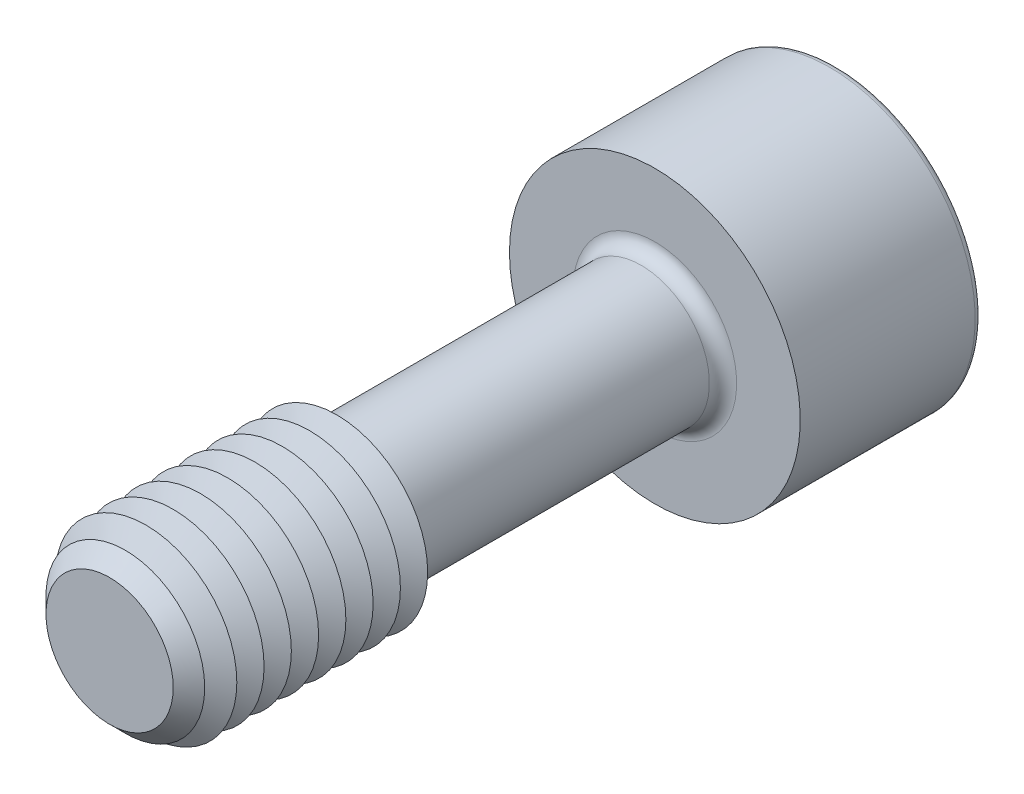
ISO-10303-21;
HEADER;
FILE_DESCRIPTION(('STEP AP214'),'2;1');
FILE_NAME('part.step','',(''),(''),'','','');
FILE_SCHEMA(('AUTOMOTIVE_DESIGN { 1 0 10303 214 1 1 1 1 }'));
ENDSEC;
DATA;
#1=APPLICATION_CONTEXT('core data for automotive mechanical design processes');
#2=APPLICATION_PROTOCOL_DEFINITION('international standard','automotive_design',2000,#1);
#3=PRODUCT_CONTEXT('',#1,'mechanical');
#4=PRODUCT('Part','Part','',(#3));
#5=PRODUCT_RELATED_PRODUCT_CATEGORY('part','',(#4));
#6=PRODUCT_DEFINITION_FORMATION('','',#4);
#7=PRODUCT_DEFINITION_CONTEXT('part definition',#1,'design');
#8=PRODUCT_DEFINITION('design','',#6,#7);
#9=PRODUCT_DEFINITION_SHAPE('','',#8);
#10=(LENGTH_UNIT() NAMED_UNIT(*) SI_UNIT(.MILLI.,.METRE.));
#11=(NAMED_UNIT(*) PLANE_ANGLE_UNIT() SI_UNIT($,.RADIAN.));
#12=(NAMED_UNIT(*) SI_UNIT($,.STERADIAN.) SOLID_ANGLE_UNIT());
#13=UNCERTAINTY_MEASURE_WITH_UNIT(LENGTH_MEASURE(1.E-05),#10,'distance_accuracy_value','');
#14=(GEOMETRIC_REPRESENTATION_CONTEXT(3) GLOBAL_UNCERTAINTY_ASSIGNED_CONTEXT((#13)) GLOBAL_UNIT_ASSIGNED_CONTEXT((#10,
#11,#12)) REPRESENTATION_CONTEXT('',''));
#15=CARTESIAN_POINT('',(0.,0.,0.));
#16=DIRECTION('',(0.,0.,1.));
#17=DIRECTION('',(1.,0.,0.));
#18=AXIS2_PLACEMENT_3D('',#15,#16,#17);
#19=CARTESIAN_POINT('',(-2.3094010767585,-4.,-17.));
#20=DIRECTION('',(0.,0.,1.));
#21=DIRECTION('',(1.,0.,0.));
#22=AXIS2_PLACEMENT_3D('',#19,#20,#21);
#23=PLANE('',#22);
#24=DIRECTION('',(1.,0.,0.));
#25=VECTOR('',#24,1.);
#26=CARTESIAN_POINT('',(-2.3094010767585,-4.,-17.));
#27=LINE('',#26,#25);
#28=CARTESIAN_POINT('',(0.,-4.,-17.));
#29=VERTEX_POINT('',#28);
#30=CARTESIAN_POINT('',(2.3094010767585,-4.,-17.));
#31=VERTEX_POINT('',#30);
#32=EDGE_CURVE('E763',#29,#31,#27,.T.);
#33=ORIENTED_EDGE('',*,*,#32,.F.);
#34=CARTESIAN_POINT('',(0.,0.,-17.));
#35=DIRECTION('',(0.,0.,1.));
#36=DIRECTION('',(0.,-1.,0.));
#37=AXIS2_PLACEMENT_3D('',#34,#35,#36);
#38=CIRCLE('',#37,4.);
#39=CARTESIAN_POINT('',(3.46410161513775,-2.,-17.));
#40=VERTEX_POINT('',#39);
#41=EDGE_CURVE('E53',#29,#40,#38,.T.);
#42=ORIENTED_EDGE('',*,*,#41,.T.);
#43=DIRECTION('',(0.5,0.866025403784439,0.));
#44=VECTOR('',#43,1.);
#45=CARTESIAN_POINT('',(2.3094010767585,-4.,-17.));
#46=LINE('',#45,#44);
#47=EDGE_CURVE('E748',#31,#40,#46,.T.);
#48=ORIENTED_EDGE('',*,*,#47,.F.);
#49=EDGE_LOOP('',(#33,#42,#48));
#50=FACE_BOUND('',#49,.T.);
#51=ADVANCED_FACE('F41',(#50),#23,.F.);
#52=CARTESIAN_POINT('',(4.618802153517,0.,-17.));
#53=VERTEX_POINT('',#52);
#54=EDGE_CURVE('E759',#40,#53,#46,.T.);
#55=ORIENTED_EDGE('',*,*,#54,.F.);
#56=CARTESIAN_POINT('',(3.46410161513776,2.,-17.));
#57=VERTEX_POINT('',#56);
#58=EDGE_CURVE('E11',#40,#57,#38,.T.);
#59=ORIENTED_EDGE('',*,*,#58,.T.);
#60=DIRECTION('',(-0.5,0.866025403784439,0.));
#61=VECTOR('',#60,1.);
#62=CARTESIAN_POINT('',(4.618802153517,0.,-17.));
#63=LINE('',#62,#61);
#64=EDGE_CURVE('E747',#53,#57,#63,.T.);
#65=ORIENTED_EDGE('',*,*,#64,.F.);
#66=EDGE_LOOP('',(#55,#59,#65));
#67=FACE_BOUND('',#66,.T.);
#68=ADVANCED_FACE('F133',(#67),#23,.F.);
#69=CARTESIAN_POINT('',(2.3094010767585,4.,-17.));
#70=VERTEX_POINT('',#69);
#71=EDGE_CURVE('E742',#57,#70,#63,.T.);
#72=ORIENTED_EDGE('',*,*,#71,.F.);
#73=CARTESIAN_POINT('',(0.,4.,-17.));
#74=VERTEX_POINT('',#73);
#75=EDGE_CURVE('E51',#57,#74,#38,.T.);
#76=ORIENTED_EDGE('',*,*,#75,.T.);
#77=DIRECTION('',(-1.,0.,0.));
#78=VECTOR('',#77,1.);
#79=CARTESIAN_POINT('',(2.3094010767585,4.,-17.));
#80=LINE('',#79,#78);
#81=EDGE_CURVE('E177',#70,#74,#80,.T.);
#82=ORIENTED_EDGE('',*,*,#81,.F.);
#83=EDGE_LOOP('',(#72,#76,#82));
#84=FACE_BOUND('',#83,.T.);
#85=ADVANCED_FACE('F139',(#84),#23,.F.);
#86=CARTESIAN_POINT('',(-2.3094010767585,4.,-17.));
#87=VERTEX_POINT('',#86);
#88=EDGE_CURVE('E753',#74,#87,#80,.T.);
#89=ORIENTED_EDGE('',*,*,#88,.F.);
#90=CARTESIAN_POINT('',(-3.46410161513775,2.,-17.));
#91=VERTEX_POINT('',#90);
#92=EDGE_CURVE('E264',#74,#91,#38,.T.);
#93=ORIENTED_EDGE('',*,*,#92,.T.);
#94=DIRECTION('',(-0.500000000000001,-0.866025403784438,0.));
#95=VECTOR('',#94,1.);
#96=CARTESIAN_POINT('',(-2.3094010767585,4.,-17.));
#97=LINE('',#96,#95);
#98=EDGE_CURVE('E176',#87,#91,#97,.T.);
#99=ORIENTED_EDGE('',*,*,#98,.F.);
#100=EDGE_LOOP('',(#89,#93,#99));
#101=FACE_BOUND('',#100,.T.);
#102=ADVANCED_FACE('F157',(#101),#23,.F.);
#103=CARTESIAN_POINT('',(-4.61880215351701,0.,-17.));
#104=VERTEX_POINT('',#103);
#105=EDGE_CURVE('E170',#91,#104,#97,.T.);
#106=ORIENTED_EDGE('',*,*,#105,.F.);
#107=CARTESIAN_POINT('',(-3.46410161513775,-2.,-17.));
#108=VERTEX_POINT('',#107);
#109=EDGE_CURVE('E172',#91,#108,#38,.T.);
#110=ORIENTED_EDGE('',*,*,#109,.T.);
#111=DIRECTION('',(0.5,-0.866025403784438,0.));
#112=VECTOR('',#111,1.);
#113=CARTESIAN_POINT('',(-4.61880215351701,0.,-17.));
#114=LINE('',#113,#112);
#115=EDGE_CURVE('E174',#104,#108,#114,.T.);
#116=ORIENTED_EDGE('',*,*,#115,.F.);
#117=EDGE_LOOP('',(#106,#110,#116));
#118=FACE_BOUND('',#117,.T.);
#119=ADVANCED_FACE('F146',(#118),#23,.F.);
#120=CARTESIAN_POINT('',(0.,0.,-25.));
#121=DIRECTION('',(0.,0.,-1.));
#122=DIRECTION('',(-1.,0.,0.));
#123=AXIS2_PLACEMENT_3D('',#120,#121,#122);
#124=PLANE('',#123);
#125=CARTESIAN_POINT('',(0.,0.,-25.));
#126=DIRECTION('',(0.,0.,-1.));
#127=DIRECTION('',(-1.,0.,0.));
#128=AXIS2_PLACEMENT_3D('',#125,#126,#127);
#129=CIRCLE('',#128,7.625);
#130=CARTESIAN_POINT('',(-7.625,0.,-25.));
#131=VERTEX_POINT('',#130);
#132=EDGE_CURVE('E250',#131,#131,#129,.T.);
#133=ORIENTED_EDGE('',*,*,#132,.T.);
#134=EDGE_LOOP('',(#133));
#135=FACE_BOUND('',#134,.T.);
#136=DIRECTION('',(-0.500000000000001,-0.866025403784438,0.));
#137=VECTOR('',#136,1.);
#138=CARTESIAN_POINT('',(-2.3094010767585,4.,-25.));
#139=LINE('',#138,#137);
#140=CARTESIAN_POINT('',(-2.3094010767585,4.,-25.));
#141=VERTEX_POINT('',#140);
#142=CARTESIAN_POINT('',(-4.61880215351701,0.,-25.));
#143=VERTEX_POINT('',#142);
#144=EDGE_CURVE('E212',#141,#143,#139,.T.);
#145=ORIENTED_EDGE('',*,*,#144,.T.);
#146=DIRECTION('',(0.5,-0.866025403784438,0.));
#147=VECTOR('',#146,1.);
#148=CARTESIAN_POINT('',(-4.61880215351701,0.,-25.));
#149=LINE('',#148,#147);
#150=CARTESIAN_POINT('',(-2.3094010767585,-4.,-25.));
#151=VERTEX_POINT('',#150);
#152=EDGE_CURVE('E67',#143,#151,#149,.T.);
#153=ORIENTED_EDGE('',*,*,#152,.T.);
#154=DIRECTION('',(1.,0.,0.));
#155=VECTOR('',#154,1.);
#156=CARTESIAN_POINT('',(-2.3094010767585,-4.,-25.));
#157=LINE('',#156,#155);
#158=CARTESIAN_POINT('',(2.3094010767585,-4.,-25.));
#159=VERTEX_POINT('',#158);
#160=EDGE_CURVE('E196',#151,#159,#157,.T.);
#161=ORIENTED_EDGE('',*,*,#160,.T.);
#162=DIRECTION('',(0.5,0.866025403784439,0.));
#163=VECTOR('',#162,1.);
#164=CARTESIAN_POINT('',(2.3094010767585,-4.,-25.));
#165=LINE('',#164,#163);
#166=CARTESIAN_POINT('',(4.618802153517,0.,-25.));
#167=VERTEX_POINT('',#166);
#168=EDGE_CURVE('E200',#159,#167,#165,.T.);
#169=ORIENTED_EDGE('',*,*,#168,.T.);
#170=DIRECTION('',(-0.5,0.866025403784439,0.));
#171=VECTOR('',#170,1.);
#172=CARTESIAN_POINT('',(4.618802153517,0.,-25.));
#173=LINE('',#172,#171);
#174=CARTESIAN_POINT('',(2.3094010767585,4.,-25.));
#175=VERTEX_POINT('',#174);
#176=EDGE_CURVE('E204',#167,#175,#173,.T.);
#177=ORIENTED_EDGE('',*,*,#176,.T.);
#178=DIRECTION('',(-1.,0.,0.));
#179=VECTOR('',#178,1.);
#180=CARTESIAN_POINT('',(2.3094010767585,4.,-25.));
#181=LINE('',#180,#179);
#182=EDGE_CURVE('E208',#175,#141,#181,.T.);
#183=ORIENTED_EDGE('',*,*,#182,.T.);
#184=EDGE_LOOP('',(#145,#153,#161,#169,#177,#183));
#185=FACE_BOUND('',#184,.T.);
#186=ADVANCED_FACE('F156',(#135,#185),#124,.T.);
#187=CARTESIAN_POINT('',(0.,0.,15.));
#188=DIRECTION('',(0.,0.,-1.));
#189=DIRECTION('',(-1.,0.,0.));
#190=AXIS2_PLACEMENT_3D('',#187,#188,#189);
#191=CYLINDRICAL_SURFACE('',#190,3.75);
#192=CARTESIAN_POINT('',(0.,0.,-14.25));
#193=DIRECTION('',(0.,0.,-1.));
#194=DIRECTION('',(-1.,0.,0.));
#195=AXIS2_PLACEMENT_3D('',#192,#193,#194);
#196=CIRCLE('',#195,3.75);
#197=CARTESIAN_POINT('',(-3.75,0.,-14.25));
#198=VERTEX_POINT('',#197);
#199=EDGE_CURVE('E246',#198,#198,#196,.F.);
#200=ORIENTED_EDGE('',*,*,#199,.T.);
#201=EDGE_LOOP('',(#200));
#202=FACE_BOUND('',#201,.T.);
#203=CARTESIAN_POINT('',(0.,0.,1.77831216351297));
#204=DIRECTION('',(0.,0.,-1.));
#205=DIRECTION('',(0.,1.,0.));
#206=AXIS2_PLACEMENT_3D('',#203,#204,#205);
#207=CIRCLE('',#206,3.75);
#208=CARTESIAN_POINT('',(0.,3.75,1.77831216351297));
#209=VERTEX_POINT('',#208);
#210=EDGE_CURVE('E234',#209,#209,#207,.T.);
#211=ORIENTED_EDGE('',*,*,#210,.T.);
#212=EDGE_LOOP('',(#211));
#213=FACE_BOUND('',#212,.T.);
#214=ADVANCED_FACE('F163',(#202,#213),#191,.T.);
#215=CARTESIAN_POINT('',(0.,0.,1.77831216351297));
#216=DIRECTION('',(0.,0.,1.));
#217=DIRECTION('',(0.,-1.,0.));
#218=AXIS2_PLACEMENT_3D('',#215,#216,#217);
#219=CONICAL_SURFACE('',#218,3.75,1.0471975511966);
#220=CARTESIAN_POINT('',(0.,0.,2.5));
#221=DIRECTION('',(0.,0.,-1.));
#222=DIRECTION('',(-1.,0.,0.));
#223=AXIS2_PLACEMENT_3D('',#220,#221,#222);
#224=CIRCLE('',#223,5.);
#225=CARTESIAN_POINT('',(-5.,0.,2.5));
#226=VERTEX_POINT('',#225);
#227=EDGE_CURVE('E268',#226,#226,#224,.T.);
#228=ORIENTED_EDGE('',*,*,#227,.T.);
#229=EDGE_LOOP('',(#228));
#230=FACE_BOUND('',#229,.T.);
#231=ORIENTED_EDGE('',*,*,#210,.F.);
#232=EDGE_LOOP('',(#231));
#233=FACE_BOUND('',#232,.T.);
#234=ADVANCED_FACE('F511',(#230,#233),#219,.T.);
#235=CARTESIAN_POINT('',(0.,0.,-15.));
#236=DIRECTION('',(0.,0.,-1.));
#237=DIRECTION('',(-1.,0.,0.));
#238=AXIS2_PLACEMENT_3D('',#235,#236,#237);
#239=PLANE('',#238);
#240=CARTESIAN_POINT('',(0.,0.,-15.));
#241=DIRECTION('',(0.,0.,-1.));
#242=DIRECTION('',(-1.,0.,0.));
#243=AXIS2_PLACEMENT_3D('',#240,#241,#242);
#244=CIRCLE('',#243,4.5);
#245=CARTESIAN_POINT('',(-4.5,0.,-15.));
#246=VERTEX_POINT('',#245);
#247=EDGE_CURVE('E242',#246,#246,#244,.T.);
#248=ORIENTED_EDGE('',*,*,#247,.T.);
#249=EDGE_LOOP('',(#248));
#250=FACE_BOUND('',#249,.T.);
#251=CARTESIAN_POINT('',(0.,0.,-15.));
#252=DIRECTION('',(0.,0.,-1.));
#253=DIRECTION('',(-1.,0.,0.));
#254=AXIS2_PLACEMENT_3D('',#251,#252,#253);
#255=CIRCLE('',#254,8.);
#256=CARTESIAN_POINT('',(-8.,0.,-15.));
#257=VERTEX_POINT('',#256);
#258=EDGE_CURVE('E230',#257,#257,#255,.T.);
#259=ORIENTED_EDGE('',*,*,#258,.F.);
#260=EDGE_LOOP('',(#259));
#261=FACE_BOUND('',#260,.T.);
#262=ADVANCED_FACE('F504',(#250,#261),#239,.F.);
#263=CARTESIAN_POINT('',(0.,0.,-25.));
#264=DIRECTION('',(0.,0.,1.));
#265=DIRECTION('',(1.,0.,0.));
#266=AXIS2_PLACEMENT_3D('',#263,#264,#265);
#267=CYLINDRICAL_SURFACE('',#266,8.);
#268=CARTESIAN_POINT('',(0.,0.,-24.625));
#269=DIRECTION('',(0.,0.,-1.));
#270=DIRECTION('',(-1.,0.,0.));
#271=AXIS2_PLACEMENT_3D('',#268,#269,#270);
#272=CIRCLE('',#271,8.);
#273=CARTESIAN_POINT('',(-8.,0.,-24.625));
#274=VERTEX_POINT('',#273);
#275=EDGE_CURVE('E253',#274,#274,#272,.F.);
#276=ORIENTED_EDGE('',*,*,#275,.T.);
#277=EDGE_LOOP('',(#276));
#278=FACE_BOUND('',#277,.T.);
#279=ORIENTED_EDGE('',*,*,#258,.T.);
#280=EDGE_LOOP('',(#279));
#281=FACE_BOUND('',#280,.T.);
#282=ADVANCED_FACE('F510',(#278,#281),#267,.T.);
#283=CARTESIAN_POINT('',(-4.61880215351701,0.,-17.));
#284=DIRECTION('',(0.866025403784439,0.5,0.));
#285=DIRECTION('',(-0.5,0.866025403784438,0.));
#286=AXIS2_PLACEMENT_3D('',#283,#284,#285);
#287=PLANE('',#286);
#288=ORIENTED_EDGE('',*,*,#152,.F.);
#289=DIRECTION('',(0.,0.,-1.));
#290=VECTOR('',#289,1.);
#291=CARTESIAN_POINT('',(-4.61880215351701,0.,-17.));
#292=LINE('',#291,#290);
#293=EDGE_CURVE('E186',#104,#143,#292,.T.);
#294=ORIENTED_EDGE('',*,*,#293,.F.);
#295=ORIENTED_EDGE('',*,*,#115,.T.);
#296=CARTESIAN_POINT('',(-2.3094010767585,-4.,-17.));
#297=VERTEX_POINT('',#296);
#298=EDGE_CURVE('E215',#108,#297,#114,.T.);
#299=ORIENTED_EDGE('',*,*,#298,.T.);
#300=DIRECTION('',(0.,0.,-1.));
#301=VECTOR('',#300,1.);
#302=CARTESIAN_POINT('',(-2.3094010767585,-4.,-17.));
#303=LINE('',#302,#301);
#304=EDGE_CURVE('E227',#297,#151,#303,.T.);
#305=ORIENTED_EDGE('',*,*,#304,.T.);
#306=EDGE_LOOP('',(#288,#294,#295,#299,#305));
#307=FACE_BOUND('',#306,.T.);
#308=ADVANCED_FACE('F522',(#307),#287,.T.);
#309=CARTESIAN_POINT('',(-2.3094010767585,-4.,-17.));
#310=DIRECTION('',(0.,1.,0.));
#311=DIRECTION('',(-1.,0.,0.));
#312=AXIS2_PLACEMENT_3D('',#309,#310,#311);
#313=PLANE('',#312);
#314=ORIENTED_EDGE('',*,*,#160,.F.);
#315=ORIENTED_EDGE('',*,*,#304,.F.);
#316=EDGE_CURVE('E760',#297,#29,#27,.T.);
#317=ORIENTED_EDGE('',*,*,#316,.T.);
#318=ORIENTED_EDGE('',*,*,#32,.T.);
#319=DIRECTION('',(0.,0.,-1.));
#320=VECTOR('',#319,1.);
#321=CARTESIAN_POINT('',(2.3094010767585,-4.,-17.));
#322=LINE('',#321,#320);
#323=EDGE_CURVE('E224',#31,#159,#322,.T.);
#324=ORIENTED_EDGE('',*,*,#323,.T.);
#325=EDGE_LOOP('',(#314,#315,#317,#318,#324));
#326=FACE_BOUND('',#325,.T.);
#327=ADVANCED_FACE('F538',(#326),#313,.T.);
#328=CARTESIAN_POINT('',(2.3094010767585,-4.,-17.));
#329=DIRECTION('',(-0.866025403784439,0.5,0.));
#330=DIRECTION('',(-0.5,-0.866025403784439,0.));
#331=AXIS2_PLACEMENT_3D('',#328,#329,#330);
#332=PLANE('',#331);
#333=ORIENTED_EDGE('',*,*,#168,.F.);
#334=ORIENTED_EDGE('',*,*,#323,.F.);
#335=ORIENTED_EDGE('',*,*,#47,.T.);
#336=ORIENTED_EDGE('',*,*,#54,.T.);
#337=DIRECTION('',(0.,0.,-1.));
#338=VECTOR('',#337,1.);
#339=CARTESIAN_POINT('',(4.618802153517,0.,-17.));
#340=LINE('',#339,#338);
#341=EDGE_CURVE('E221',#53,#167,#340,.T.);
#342=ORIENTED_EDGE('',*,*,#341,.T.);
#343=EDGE_LOOP('',(#333,#334,#335,#336,#342));
#344=FACE_BOUND('',#343,.T.);
#345=ADVANCED_FACE('F548',(#344),#332,.T.);
#346=CARTESIAN_POINT('',(4.618802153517,0.,-17.));
#347=DIRECTION('',(-0.866025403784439,-0.5,0.));
#348=DIRECTION('',(0.5,-0.866025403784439,0.));
#349=AXIS2_PLACEMENT_3D('',#346,#347,#348);
#350=PLANE('',#349);
#351=ORIENTED_EDGE('',*,*,#176,.F.);
#352=ORIENTED_EDGE('',*,*,#341,.F.);
#353=ORIENTED_EDGE('',*,*,#64,.T.);
#354=ORIENTED_EDGE('',*,*,#71,.T.);
#355=DIRECTION('',(0.,0.,-1.));
#356=VECTOR('',#355,1.);
#357=CARTESIAN_POINT('',(2.3094010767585,4.,-17.));
#358=LINE('',#357,#356);
#359=EDGE_CURVE('E218',#70,#175,#358,.T.);
#360=ORIENTED_EDGE('',*,*,#359,.T.);
#361=EDGE_LOOP('',(#351,#352,#353,#354,#360));
#362=FACE_BOUND('',#361,.T.);
#363=ADVANCED_FACE('F558',(#362),#350,.T.);
#364=CARTESIAN_POINT('',(2.3094010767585,4.,-17.));
#365=DIRECTION('',(0.,-1.,0.));
#366=DIRECTION('',(0.,0.,-1.));
#367=AXIS2_PLACEMENT_3D('',#364,#365,#366);
#368=PLANE('',#367);
#369=ORIENTED_EDGE('',*,*,#182,.F.);
#370=ORIENTED_EDGE('',*,*,#359,.F.);
#371=ORIENTED_EDGE('',*,*,#81,.T.);
#372=ORIENTED_EDGE('',*,*,#88,.T.);
#373=DIRECTION('',(0.,0.,-1.));
#374=VECTOR('',#373,1.);
#375=CARTESIAN_POINT('',(-2.3094010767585,4.,-17.));
#376=LINE('',#375,#374);
#377=EDGE_CURVE('E182',#87,#141,#376,.T.);
#378=ORIENTED_EDGE('',*,*,#377,.T.);
#379=EDGE_LOOP('',(#369,#370,#371,#372,#378));
#380=FACE_BOUND('',#379,.T.);
#381=ADVANCED_FACE('F152',(#380),#368,.T.);
#382=CARTESIAN_POINT('',(-2.3094010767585,4.,-17.));
#383=DIRECTION('',(0.866025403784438,-0.500000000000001,0.));
#384=DIRECTION('',(0.500000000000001,0.866025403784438,0.));
#385=AXIS2_PLACEMENT_3D('',#382,#383,#384);
#386=PLANE('',#385);
#387=ORIENTED_EDGE('',*,*,#144,.F.);
#388=ORIENTED_EDGE('',*,*,#377,.F.);
#389=ORIENTED_EDGE('',*,*,#98,.T.);
#390=ORIENTED_EDGE('',*,*,#105,.T.);
#391=ORIENTED_EDGE('',*,*,#293,.T.);
#392=EDGE_LOOP('',(#387,#388,#389,#390,#391));
#393=FACE_BOUND('',#392,.T.);
#394=ADVANCED_FACE('F144',(#393),#386,.T.);
#395=ORIENTED_EDGE('',*,*,#298,.F.);
#396=EDGE_CURVE('E256',#108,#29,#38,.T.);
#397=ORIENTED_EDGE('',*,*,#396,.T.);
#398=ORIENTED_EDGE('',*,*,#316,.F.);
#399=EDGE_LOOP('',(#395,#397,#398));
#400=FACE_BOUND('',#399,.T.);
#401=ADVANCED_FACE('F135',(#400),#23,.F.);
#402=CARTESIAN_POINT('',(0.,0.,-14.25));
#403=DIRECTION('',(0.,0.,-1.));
#404=DIRECTION('',(-1.,0.,0.));
#405=AXIS2_PLACEMENT_3D('',#402,#403,#404);
#406=TOROIDAL_SURFACE('',#405,4.5,0.75);
#407=ORIENTED_EDGE('',*,*,#199,.F.);
#408=EDGE_LOOP('',(#407));
#409=FACE_BOUND('',#408,.T.);
#410=ORIENTED_EDGE('',*,*,#247,.F.);
#411=EDGE_LOOP('',(#410));
#412=FACE_BOUND('',#411,.T.);
#413=ADVANCED_FACE('F129',(#409,#412),#406,.F.);
#414=CARTESIAN_POINT('',(0.,0.,-24.625));
#415=DIRECTION('',(0.,0.,-1.));
#416=DIRECTION('',(-1.,0.,0.));
#417=AXIS2_PLACEMENT_3D('',#414,#415,#416);
#418=TOROIDAL_SURFACE('',#417,7.625,0.375);
#419=ORIENTED_EDGE('',*,*,#275,.F.);
#420=EDGE_LOOP('',(#419));
#421=FACE_BOUND('',#420,.T.);
#422=ORIENTED_EDGE('',*,*,#132,.F.);
#423=EDGE_LOOP('',(#422));
#424=FACE_BOUND('',#423,.T.);
#425=ADVANCED_FACE('F43',(#421,#424),#418,.T.);
#426=CARTESIAN_POINT('',(0.,0.,-14.6905989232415));
#427=DIRECTION('',(0.,0.,-1.));
#428=DIRECTION('',(0.,1.,0.));
#429=AXIS2_PLACEMENT_3D('',#426,#427,#428);
#430=CONICAL_SURFACE('',#429,0.,1.0471975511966);
#431=ORIENTED_EDGE('',*,*,#41,.F.);
#432=ORIENTED_EDGE('',*,*,#396,.F.);
#433=ORIENTED_EDGE('',*,*,#109,.F.);
#434=ORIENTED_EDGE('',*,*,#92,.F.);
#435=ORIENTED_EDGE('',*,*,#75,.F.);
#436=ORIENTED_EDGE('',*,*,#58,.F.);
#437=EDGE_LOOP('',(#431,#432,#433,#434,#435,#436));
#438=FACE_BOUND('',#437,.T.);
#439=CARTESIAN_POINT('',(0.,0.,-14.6905989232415));
#440=VERTEX_POINT('',#439);
#441=VERTEX_LOOP('',#440);
#442=FACE_BOUND('',#441,.T.);
#443=ADVANCED_FACE('F118',(#438,#442),#430,.F.);
#444=CARTESIAN_POINT('',(0.,0.,3.25));
#445=DIRECTION('',(0.,0.,-1.));
#446=DIRECTION('',(-1.,0.,0.));
#447=AXIS2_PLACEMENT_3D('',#444,#445,#446);
#448=CONICAL_SURFACE('',#447,3.70096189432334,1.0471975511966);
#449=ORIENTED_EDGE('',*,*,#227,.F.);
#450=EDGE_LOOP('',(#449));
#451=FACE_BOUND('',#450,.T.);
#452=CARTESIAN_POINT('',(0.,0.,3.25));
#453=DIRECTION('',(0.,0.,-1.));
#454=DIRECTION('',(-1.,0.,0.));
#455=AXIS2_PLACEMENT_3D('',#452,#453,#454);
#456=CIRCLE('',#455,3.70096189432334);
#457=CARTESIAN_POINT('',(-3.70096189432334,0.,3.25));
#458=VERTEX_POINT('',#457);
#459=EDGE_CURVE('E274',#458,#458,#456,.T.);
#460=ORIENTED_EDGE('',*,*,#459,.T.);
#461=EDGE_LOOP('',(#460));
#462=FACE_BOUND('',#461,.T.);
#463=ADVANCED_FACE('F120',(#451,#462),#448,.T.);
#464=CARTESIAN_POINT('',(0.,0.,4.));
#465=DIRECTION('',(0.,0.,1.));
#466=DIRECTION('',(1.,0.,0.));
#467=AXIS2_PLACEMENT_3D('',#464,#465,#466);
#468=CONICAL_SURFACE('',#467,5.,1.0471975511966);
#469=ORIENTED_EDGE('',*,*,#459,.F.);
#470=EDGE_LOOP('',(#469));
#471=FACE_BOUND('',#470,.T.);
#472=CARTESIAN_POINT('',(0.,0.,4.));
#473=DIRECTION('',(0.,0.,-1.));
#474=DIRECTION('',(-1.,0.,0.));
#475=AXIS2_PLACEMENT_3D('',#472,#473,#474);
#476=CIRCLE('',#475,5.);
#477=CARTESIAN_POINT('',(-5.,0.,4.));
#478=VERTEX_POINT('',#477);
#479=EDGE_CURVE('E279',#478,#478,#476,.T.);
#480=ORIENTED_EDGE('',*,*,#479,.T.);
#481=EDGE_LOOP('',(#480));
#482=FACE_BOUND('',#481,.T.);
#483=ADVANCED_FACE('F126',(#471,#482),#468,.T.);
#484=CARTESIAN_POINT('',(0.,0.,4.75));
#485=DIRECTION('',(0.,0.,-1.));
#486=DIRECTION('',(-1.,0.,0.));
#487=AXIS2_PLACEMENT_3D('',#484,#485,#486);
#488=CONICAL_SURFACE('',#487,3.70096189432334,1.0471975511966);
#489=ORIENTED_EDGE('',*,*,#479,.F.);
#490=EDGE_LOOP('',(#489));
#491=FACE_BOUND('',#490,.T.);
#492=CARTESIAN_POINT('',(0.,0.,4.75));
#493=DIRECTION('',(0.,0.,-1.));
#494=DIRECTION('',(-1.,0.,0.));
#495=AXIS2_PLACEMENT_3D('',#492,#493,#494);
#496=CIRCLE('',#495,3.70096189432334);
#497=CARTESIAN_POINT('',(-3.70096189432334,0.,4.75));
#498=VERTEX_POINT('',#497);
#499=EDGE_CURVE('E285',#498,#498,#496,.T.);
#500=ORIENTED_EDGE('',*,*,#499,.T.);
#501=EDGE_LOOP('',(#500));
#502=FACE_BOUND('',#501,.T.);
#503=ADVANCED_FACE('F398',(#491,#502),#488,.T.);
#504=CARTESIAN_POINT('',(0.,0.,5.5));
#505=DIRECTION('',(0.,0.,1.));
#506=DIRECTION('',(1.,0.,0.));
#507=AXIS2_PLACEMENT_3D('',#504,#505,#506);
#508=CONICAL_SURFACE('',#507,5.,1.0471975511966);
#509=ORIENTED_EDGE('',*,*,#499,.F.);
#510=EDGE_LOOP('',(#509));
#511=FACE_BOUND('',#510,.T.);
#512=CARTESIAN_POINT('',(0.,0.,5.5));
#513=DIRECTION('',(0.,0.,-1.));
#514=DIRECTION('',(-1.,0.,0.));
#515=AXIS2_PLACEMENT_3D('',#512,#513,#514);
#516=CIRCLE('',#515,5.);
#517=CARTESIAN_POINT('',(-5.,0.,5.5));
#518=VERTEX_POINT('',#517);
#519=EDGE_CURVE('E289',#518,#518,#516,.T.);
#520=ORIENTED_EDGE('',*,*,#519,.T.);
#521=EDGE_LOOP('',(#520));
#522=FACE_BOUND('',#521,.T.);
#523=ADVANCED_FACE('F394',(#511,#522),#508,.T.);
#524=CARTESIAN_POINT('',(0.,0.,6.25));
#525=DIRECTION('',(0.,0.,-1.));
#526=DIRECTION('',(-1.,0.,0.));
#527=AXIS2_PLACEMENT_3D('',#524,#525,#526);
#528=CONICAL_SURFACE('',#527,3.70096189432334,1.0471975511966);
#529=ORIENTED_EDGE('',*,*,#519,.F.);
#530=EDGE_LOOP('',(#529));
#531=FACE_BOUND('',#530,.T.);
#532=CARTESIAN_POINT('',(0.,0.,6.25));
#533=DIRECTION('',(0.,0.,-1.));
#534=DIRECTION('',(-1.,0.,0.));
#535=AXIS2_PLACEMENT_3D('',#532,#533,#534);
#536=CIRCLE('',#535,3.70096189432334);
#537=CARTESIAN_POINT('',(-3.70096189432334,0.,6.25));
#538=VERTEX_POINT('',#537);
#539=EDGE_CURVE('E293',#538,#538,#536,.T.);
#540=ORIENTED_EDGE('',*,*,#539,.T.);
#541=EDGE_LOOP('',(#540));
#542=FACE_BOUND('',#541,.T.);
#543=ADVANCED_FACE('F390',(#531,#542),#528,.T.);
#544=CARTESIAN_POINT('',(0.,0.,7.));
#545=DIRECTION('',(0.,0.,1.));
#546=DIRECTION('',(1.,0.,0.));
#547=AXIS2_PLACEMENT_3D('',#544,#545,#546);
#548=CONICAL_SURFACE('',#547,5.,1.0471975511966);
#549=ORIENTED_EDGE('',*,*,#539,.F.);
#550=EDGE_LOOP('',(#549));
#551=FACE_BOUND('',#550,.T.);
#552=CARTESIAN_POINT('',(0.,0.,7.));
#553=DIRECTION('',(0.,0.,-1.));
#554=DIRECTION('',(-1.,0.,0.));
#555=AXIS2_PLACEMENT_3D('',#552,#553,#554);
#556=CIRCLE('',#555,5.);
#557=CARTESIAN_POINT('',(-5.,0.,7.));
#558=VERTEX_POINT('',#557);
#559=EDGE_CURVE('E296',#558,#558,#556,.T.);
#560=ORIENTED_EDGE('',*,*,#559,.T.);
#561=EDGE_LOOP('',(#560));
#562=FACE_BOUND('',#561,.T.);
#563=ADVANCED_FACE('F386',(#551,#562),#548,.T.);
#564=CARTESIAN_POINT('',(0.,0.,7.75));
#565=DIRECTION('',(0.,0.,-1.));
#566=DIRECTION('',(-1.,0.,0.));
#567=AXIS2_PLACEMENT_3D('',#564,#565,#566);
#568=CONICAL_SURFACE('',#567,3.70096189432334,1.0471975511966);
#569=ORIENTED_EDGE('',*,*,#559,.F.);
#570=EDGE_LOOP('',(#569));
#571=FACE_BOUND('',#570,.T.);
#572=CARTESIAN_POINT('',(0.,0.,7.75));
#573=DIRECTION('',(0.,0.,-1.));
#574=DIRECTION('',(-1.,0.,0.));
#575=AXIS2_PLACEMENT_3D('',#572,#573,#574);
#576=CIRCLE('',#575,3.70096189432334);
#577=CARTESIAN_POINT('',(-3.70096189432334,0.,7.75));
#578=VERTEX_POINT('',#577);
#579=EDGE_CURVE('E300',#578,#578,#576,.T.);
#580=ORIENTED_EDGE('',*,*,#579,.T.);
#581=EDGE_LOOP('',(#580));
#582=FACE_BOUND('',#581,.T.);
#583=ADVANCED_FACE('F382',(#571,#582),#568,.T.);
#584=CARTESIAN_POINT('',(0.,0.,8.5));
#585=DIRECTION('',(0.,0.,1.));
#586=DIRECTION('',(1.,0.,0.));
#587=AXIS2_PLACEMENT_3D('',#584,#585,#586);
#588=CONICAL_SURFACE('',#587,5.,1.0471975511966);
#589=ORIENTED_EDGE('',*,*,#579,.F.);
#590=EDGE_LOOP('',(#589));
#591=FACE_BOUND('',#590,.T.);
#592=CARTESIAN_POINT('',(0.,0.,8.5));
#593=DIRECTION('',(0.,0.,-1.));
#594=DIRECTION('',(-1.,0.,0.));
#595=AXIS2_PLACEMENT_3D('',#592,#593,#594);
#596=CIRCLE('',#595,5.);
#597=CARTESIAN_POINT('',(-5.,0.,8.5));
#598=VERTEX_POINT('',#597);
#599=EDGE_CURVE('E304',#598,#598,#596,.T.);
#600=ORIENTED_EDGE('',*,*,#599,.T.);
#601=EDGE_LOOP('',(#600));
#602=FACE_BOUND('',#601,.T.);
#603=ADVANCED_FACE('F378',(#591,#602),#588,.T.);
#604=CARTESIAN_POINT('',(0.,0.,9.25));
#605=DIRECTION('',(0.,0.,-1.));
#606=DIRECTION('',(-1.,0.,0.));
#607=AXIS2_PLACEMENT_3D('',#604,#605,#606);
#608=CONICAL_SURFACE('',#607,3.70096189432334,1.0471975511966);
#609=ORIENTED_EDGE('',*,*,#599,.F.);
#610=EDGE_LOOP('',(#609));
#611=FACE_BOUND('',#610,.T.);
#612=CARTESIAN_POINT('',(0.,0.,9.25));
#613=DIRECTION('',(0.,0.,-1.));
#614=DIRECTION('',(-1.,0.,0.));
#615=AXIS2_PLACEMENT_3D('',#612,#613,#614);
#616=CIRCLE('',#615,3.70096189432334);
#617=CARTESIAN_POINT('',(-3.70096189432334,0.,9.25));
#618=VERTEX_POINT('',#617);
#619=EDGE_CURVE('E308',#618,#618,#616,.T.);
#620=ORIENTED_EDGE('',*,*,#619,.T.);
#621=EDGE_LOOP('',(#620));
#622=FACE_BOUND('',#621,.T.);
#623=ADVANCED_FACE('F374',(#611,#622),#608,.T.);
#624=CARTESIAN_POINT('',(0.,0.,10.));
#625=DIRECTION('',(0.,0.,1.));
#626=DIRECTION('',(1.,0.,0.));
#627=AXIS2_PLACEMENT_3D('',#624,#625,#626);
#628=CONICAL_SURFACE('',#627,5.,1.0471975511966);
#629=ORIENTED_EDGE('',*,*,#619,.F.);
#630=EDGE_LOOP('',(#629));
#631=FACE_BOUND('',#630,.T.);
#632=CARTESIAN_POINT('',(0.,0.,10.));
#633=DIRECTION('',(0.,0.,-1.));
#634=DIRECTION('',(-1.,0.,0.));
#635=AXIS2_PLACEMENT_3D('',#632,#633,#634);
#636=CIRCLE('',#635,5.);
#637=CARTESIAN_POINT('',(-5.,0.,10.));
#638=VERTEX_POINT('',#637);
#639=EDGE_CURVE('E312',#638,#638,#636,.T.);
#640=ORIENTED_EDGE('',*,*,#639,.T.);
#641=EDGE_LOOP('',(#640));
#642=FACE_BOUND('',#641,.T.);
#643=ADVANCED_FACE('F370',(#631,#642),#628,.T.);
#644=CARTESIAN_POINT('',(0.,0.,10.75));
#645=DIRECTION('',(0.,0.,-1.));
#646=DIRECTION('',(-1.,0.,0.));
#647=AXIS2_PLACEMENT_3D('',#644,#645,#646);
#648=CONICAL_SURFACE('',#647,3.70096189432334,1.0471975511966);
#649=ORIENTED_EDGE('',*,*,#639,.F.);
#650=EDGE_LOOP('',(#649));
#651=FACE_BOUND('',#650,.T.);
#652=CARTESIAN_POINT('',(0.,0.,10.75));
#653=DIRECTION('',(0.,0.,-1.));
#654=DIRECTION('',(-1.,0.,0.));
#655=AXIS2_PLACEMENT_3D('',#652,#653,#654);
#656=CIRCLE('',#655,3.70096189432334);
#657=CARTESIAN_POINT('',(-3.70096189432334,0.,10.75));
#658=VERTEX_POINT('',#657);
#659=EDGE_CURVE('E316',#658,#658,#656,.T.);
#660=ORIENTED_EDGE('',*,*,#659,.T.);
#661=EDGE_LOOP('',(#660));
#662=FACE_BOUND('',#661,.T.);
#663=ADVANCED_FACE('F366',(#651,#662),#648,.T.);
#664=CARTESIAN_POINT('',(0.,0.,11.5));
#665=DIRECTION('',(0.,0.,1.));
#666=DIRECTION('',(1.,0.,0.));
#667=AXIS2_PLACEMENT_3D('',#664,#665,#666);
#668=CONICAL_SURFACE('',#667,5.,1.0471975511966);
#669=ORIENTED_EDGE('',*,*,#659,.F.);
#670=EDGE_LOOP('',(#669));
#671=FACE_BOUND('',#670,.T.);
#672=CARTESIAN_POINT('',(0.,0.,11.5));
#673=DIRECTION('',(0.,0.,-1.));
#674=DIRECTION('',(-1.,0.,0.));
#675=AXIS2_PLACEMENT_3D('',#672,#673,#674);
#676=CIRCLE('',#675,5.);
#677=CARTESIAN_POINT('',(-5.,0.,11.5));
#678=VERTEX_POINT('',#677);
#679=EDGE_CURVE('E320',#678,#678,#676,.T.);
#680=ORIENTED_EDGE('',*,*,#679,.T.);
#681=EDGE_LOOP('',(#680));
#682=FACE_BOUND('',#681,.T.);
#683=ADVANCED_FACE('F362',(#671,#682),#668,.T.);
#684=CARTESIAN_POINT('',(0.,0.,12.25));
#685=DIRECTION('',(0.,0.,-1.));
#686=DIRECTION('',(-1.,0.,0.));
#687=AXIS2_PLACEMENT_3D('',#684,#685,#686);
#688=CONICAL_SURFACE('',#687,3.70096189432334,1.0471975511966);
#689=ORIENTED_EDGE('',*,*,#679,.F.);
#690=EDGE_LOOP('',(#689));
#691=FACE_BOUND('',#690,.T.);
#692=CARTESIAN_POINT('',(0.,0.,12.25));
#693=DIRECTION('',(0.,0.,-1.));
#694=DIRECTION('',(-1.,0.,0.));
#695=AXIS2_PLACEMENT_3D('',#692,#693,#694);
#696=CIRCLE('',#695,3.70096189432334);
#697=CARTESIAN_POINT('',(-3.70096189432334,0.,12.25));
#698=VERTEX_POINT('',#697);
#699=EDGE_CURVE('E324',#698,#698,#696,.T.);
#700=ORIENTED_EDGE('',*,*,#699,.T.);
#701=EDGE_LOOP('',(#700));
#702=FACE_BOUND('',#701,.T.);
#703=ADVANCED_FACE('F358',(#691,#702),#688,.T.);
#704=CARTESIAN_POINT('',(0.,0.,13.));
#705=DIRECTION('',(0.,0.,1.));
#706=DIRECTION('',(1.,0.,0.));
#707=AXIS2_PLACEMENT_3D('',#704,#705,#706);
#708=CONICAL_SURFACE('',#707,5.,1.0471975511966);
#709=ORIENTED_EDGE('',*,*,#699,.F.);
#710=EDGE_LOOP('',(#709));
#711=FACE_BOUND('',#710,.T.);
#712=CARTESIAN_POINT('',(0.,0.,13.));
#713=DIRECTION('',(0.,0.,-1.));
#714=DIRECTION('',(-1.,0.,0.));
#715=AXIS2_PLACEMENT_3D('',#712,#713,#714);
#716=CIRCLE('',#715,5.);
#717=CARTESIAN_POINT('',(-5.,0.,13.));
#718=VERTEX_POINT('',#717);
#719=EDGE_CURVE('E328',#718,#718,#716,.T.);
#720=ORIENTED_EDGE('',*,*,#719,.T.);
#721=EDGE_LOOP('',(#720));
#722=FACE_BOUND('',#721,.T.);
#723=ADVANCED_FACE('F351',(#711,#722),#708,.T.);
#724=CARTESIAN_POINT('',(0.,0.,13.75));
#725=DIRECTION('',(0.,0.,-1.));
#726=DIRECTION('',(-1.,0.,0.));
#727=AXIS2_PLACEMENT_3D('',#724,#725,#726);
#728=CONICAL_SURFACE('',#727,3.70096189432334,1.0471975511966);
#729=ORIENTED_EDGE('',*,*,#719,.F.);
#730=EDGE_LOOP('',(#729));
#731=FACE_BOUND('',#730,.T.);
#732=CARTESIAN_POINT('',(0.,0.,13.75));
#733=DIRECTION('',(0.,0.,-1.));
#734=DIRECTION('',(-1.,0.,0.));
#735=AXIS2_PLACEMENT_3D('',#732,#733,#734);
#736=CIRCLE('',#735,3.70096189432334);
#737=CARTESIAN_POINT('',(-3.70096189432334,0.,13.75));
#738=VERTEX_POINT('',#737);
#739=EDGE_CURVE('E332',#738,#738,#736,.T.);
#740=ORIENTED_EDGE('',*,*,#739,.T.);
#741=EDGE_LOOP('',(#740));
#742=FACE_BOUND('',#741,.T.);
#743=ADVANCED_FACE('F337',(#731,#742),#728,.T.);
#744=CARTESIAN_POINT('',(0.,0.,14.5));
#745=DIRECTION('',(0.,0.,1.));
#746=DIRECTION('',(1.,0.,0.));
#747=AXIS2_PLACEMENT_3D('',#744,#745,#746);
#748=CONICAL_SURFACE('',#747,5.,1.0471975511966);
#749=CARTESIAN_POINT('',(0.,0.,14.1339745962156));
#750=DIRECTION('',(0.,0.,1.));
#751=DIRECTION('',(1.,0.,0.));
#752=AXIS2_PLACEMENT_3D('',#749,#750,#751);
#753=CIRCLE('',#752,4.36602540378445);
#754=CARTESIAN_POINT('',(4.36602540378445,0.,14.1339745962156));
#755=VERTEX_POINT('',#754);
#756=EDGE_CURVE('E45',#755,#755,#753,.F.);
#757=ORIENTED_EDGE('',*,*,#756,.T.);
#758=EDGE_LOOP('',(#757));
#759=FACE_BOUND('',#758,.T.);
#760=ORIENTED_EDGE('',*,*,#739,.F.);
#761=EDGE_LOOP('',(#760));
#762=FACE_BOUND('',#761,.T.);
#763=ADVANCED_FACE('F339',(#759,#762),#748,.T.);
#764=CARTESIAN_POINT('',(0.,0.,15.));
#765=DIRECTION('',(0.,0.,1.));
#766=DIRECTION('',(1.,0.,0.));
#767=AXIS2_PLACEMENT_3D('',#764,#765,#766);
#768=PLANE('',#767);
#769=CARTESIAN_POINT('',(0.,0.,15.));
#770=DIRECTION('',(0.,0.,1.));
#771=DIRECTION('',(1.,0.,0.));
#772=AXIS2_PLACEMENT_3D('',#769,#770,#771);
#773=CIRCLE('',#772,3.50000000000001);
#774=CARTESIAN_POINT('',(3.50000000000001,0.,15.));
#775=VERTEX_POINT('',#774);
#776=EDGE_CURVE('E238',#775,#775,#773,.T.);
#777=ORIENTED_EDGE('',*,*,#776,.T.);
#778=EDGE_LOOP('',(#777));
#779=FACE_BOUND('',#778,.T.);
#780=ADVANCED_FACE('F341',(#779),#768,.T.);
#781=CARTESIAN_POINT('',(0.,0.,13.5));
#782=DIRECTION('',(0.,0.,-1.));
#783=DIRECTION('',(0.,1.,0.));
#784=AXIS2_PLACEMENT_3D('',#781,#782,#783);
#785=CONICAL_SURFACE('',#784,5.,0.785398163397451);
#786=ORIENTED_EDGE('',*,*,#756,.F.);
#787=EDGE_LOOP('',(#786));
#788=FACE_BOUND('',#787,.T.);
#789=ORIENTED_EDGE('',*,*,#776,.F.);
#790=EDGE_LOOP('',(#789));
#791=FACE_BOUND('',#790,.T.);
#792=ADVANCED_FACE('F348',(#788,#791),#785,.T.);
#793=CLOSED_SHELL('',(#51,#68,#85,#102,#119,#186,#214,#234,#262,#282,#308,#327,#345,#363,#381,
#394,#401,#413,#425,#443,#463,#483,#503,#523,#543,#563,#583,#603,#623,#643,#663,#683,#703,#723,
#743,#763,#780,#792));
#794=MANIFOLD_SOLID_BREP('B2',#793);
#795=ADVANCED_BREP_SHAPE_REPRESENTATION('',(#18,#794),#14);
#796=SHAPE_DEFINITION_REPRESENTATION(#9,#795);
ENDSEC;
END-ISO-10303-21;
